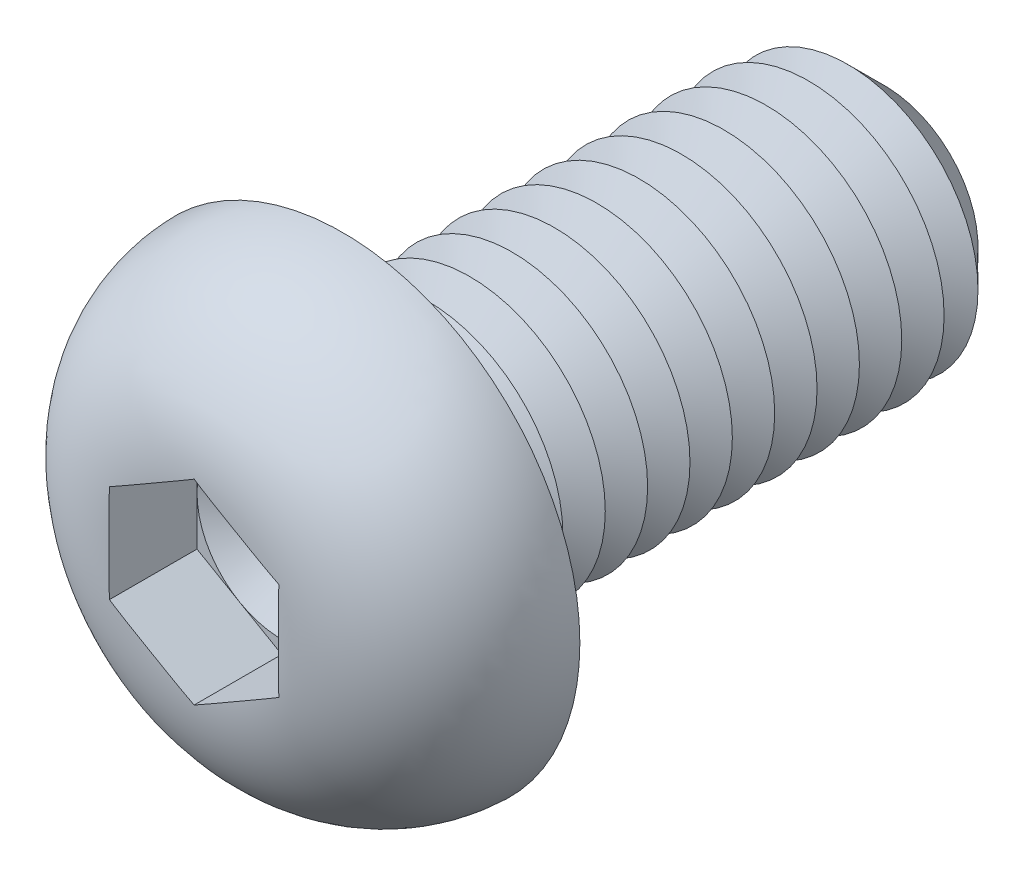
from build123d import *

# Parameters (mm, degrees)
CUT_EXTRUDE1_DEPTH  = 2.6
SKETCH4_R           = 4
BOSS_EXTRUDE1_DEPTH = 16
CHAMFER1_SIZE       = 1.25
LPATTERN1_COUNT     = 11
LPATTERN1_PITCH     = 1.25
FILLET2_R           = 0.5


with BuildPart() as part:
    # Sketch2 → Revolve1 (revolve)
    with BuildSketch(Plane(origin=(0, 0, 0), x_dir=(0, 0, -1), z_dir=(1, 0, 0)), mode=Mode.PRIVATE) as revolve1_sk:
        with BuildLine():
            Line((0, 0), (-4.4, 0))
            Line((-4.4, 0), (-4.4, 2.501111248))
            ThreePointArc((-4.4, 2.501111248), (-3.117141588, 5.647537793), (0, 7))
            Line((0, 7), (0, 0))
        make_face()
    revolve(revolve1_sk.sketch.rotate(Axis((0, 0, 47.934239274), (0, 0, -1)), 90), axis=Axis((0, 0, 47.934239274), (0, 0, -1)))

    # Sketch3 → Cut-Extrude1 (cut)
    with BuildSketch(Plane.XY.offset(4.4)):
        Polygon((0, 2.886751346), (-2.5, 1.443375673), (-2.5, -1.443375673), (0, -2.886751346), (2.5, -1.443375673), (2.5, 1.443375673), align=None)
    extrude(amount=-CUT_EXTRUDE1_DEPTH, mode=Mode.SUBTRACT)

    # Sketch4 → Boss-Extrude1 (add)
    with BuildSketch(Plane(origin=(0, 0, 0), x_dir=(-1, 0, 0), z_dir=(0, 0, -1))):
        with Locations(Location((0, 0, 0), (0, 0, 180))):
            Circle(SKETCH4_R)
    extrude(amount=BOSS_EXTRUDE1_DEPTH)

    # Chamfer1
    chamfer1_edges = [part.edges().sort_by_distance(p)[0] for p in [
        (-4, 0, -16),
    ]]
    chamfer(chamfer1_edges, length=CHAMFER1_SIZE)

    # Sketch5 → Cut-Revolve1 (revolve, cut)
    with BuildSketch(Plane(origin=(0, 0, 0), x_dir=(0, 0, -1), z_dir=(1, 0, 0)), mode=Mode.PRIVATE) as cut_revolve1_sk:
        Polygon((1.25, 4), (2.5, 4), (1.875, 2.917468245), align=None)
    cut_revolve1 = revolve(cut_revolve1_sk.sketch.rotate(Axis((0, 0, 47.934239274), (0, 0, -1)), 90), axis=Axis((0, 0, 47.934239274), (0, 0, -1)), mode=Mode.SUBTRACT)

    # LPattern1: Cut-Revolve1 ×11
    with Locations(*[(0, 0, -i * LPATTERN1_PITCH) for i in range(1, LPATTERN1_COUNT)]):
        add(cut_revolve1, mode=Mode.SUBTRACT)

    # Fillet2
    fillet2_edges = [part.edges().sort_by_distance(p)[0] for p in [
        (-4, 0, 0),
    ]]
    fillet(fillet2_edges, radius=FILLET2_R)

    # Cut-Extrude2 cone 1 section (on through the dimple's axis) → Cut-Extrude2 (revolve, cut)
    with BuildSketch(Plane(origin=(0, 0, 1.8), x_dir=(0, -1, 0), z_dir=(1, 0, 0))):
        Polygon((0, 0), (2.5, 0), (0, 1.443375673), align=None)
    revolve(axis=Axis((0, 0, 1.8), (0, 0, -1)), mode=Mode.SUBTRACT)


solid = part.part
